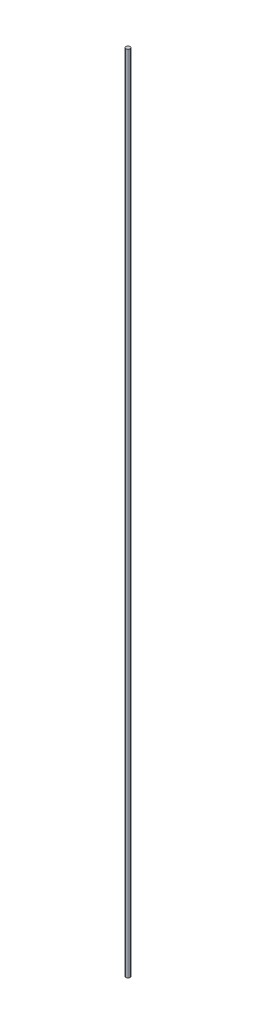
ISO-10303-21;
HEADER;
FILE_DESCRIPTION(('STEP AP214'),'2;1');
FILE_NAME('part.step','',(''),(''),'','','');
FILE_SCHEMA(('AUTOMOTIVE_DESIGN { 1 0 10303 214 1 1 1 1 }'));
ENDSEC;
DATA;
#1=APPLICATION_CONTEXT('core data for automotive mechanical design processes');
#2=APPLICATION_PROTOCOL_DEFINITION('international standard','automotive_design',2000,#1);
#3=PRODUCT_CONTEXT('',#1,'mechanical');
#4=PRODUCT('Part','Part','',(#3));
#5=PRODUCT_RELATED_PRODUCT_CATEGORY('part','',(#4));
#6=PRODUCT_DEFINITION_FORMATION('','',#4);
#7=PRODUCT_DEFINITION_CONTEXT('part definition',#1,'design');
#8=PRODUCT_DEFINITION('design','',#6,#7);
#9=PRODUCT_DEFINITION_SHAPE('','',#8);
#10=(LENGTH_UNIT() NAMED_UNIT(*) SI_UNIT(.MILLI.,.METRE.));
#11=(NAMED_UNIT(*) PLANE_ANGLE_UNIT() SI_UNIT($,.RADIAN.));
#12=(NAMED_UNIT(*) SI_UNIT($,.STERADIAN.) SOLID_ANGLE_UNIT());
#13=UNCERTAINTY_MEASURE_WITH_UNIT(LENGTH_MEASURE(1.E-05),#10,'distance_accuracy_value','');
#14=(GEOMETRIC_REPRESENTATION_CONTEXT(3) GLOBAL_UNCERTAINTY_ASSIGNED_CONTEXT((#13)) GLOBAL_UNIT_ASSIGNED_CONTEXT((#10,
#11,#12)) REPRESENTATION_CONTEXT('',''));
#15=CARTESIAN_POINT('',(0.,0.,0.));
#16=DIRECTION('',(0.,0.,1.));
#17=DIRECTION('',(1.,0.,0.));
#18=AXIS2_PLACEMENT_3D('',#15,#16,#17);
#19=CARTESIAN_POINT('',(0.,7620.,0.));
#20=DIRECTION('',(0.,-1.,0.));
#21=DIRECTION('',(0.,0.,-1.));
#22=AXIS2_PLACEMENT_3D('',#19,#20,#21);
#23=CYLINDRICAL_SURFACE('',#22,19.05);
#24=CARTESIAN_POINT('',(0.,7620.,0.));
#25=DIRECTION('',(0.,1.,0.));
#26=DIRECTION('',(0.,0.,1.));
#27=AXIS2_PLACEMENT_3D('',#24,#25,#26);
#28=CIRCLE('',#27,19.05);
#29=CARTESIAN_POINT('',(0.,7620.,19.05));
#30=VERTEX_POINT('',#29);
#31=EDGE_CURVE('E10',#30,#30,#28,.T.);
#32=ORIENTED_EDGE('',*,*,#31,.F.);
#33=EDGE_LOOP('',(#32));
#34=FACE_BOUND('',#33,.T.);
#35=CARTESIAN_POINT('',(0.,0.,0.));
#36=DIRECTION('',(0.,1.,0.));
#37=DIRECTION('',(0.,0.,1.));
#38=AXIS2_PLACEMENT_3D('',#35,#36,#37);
#39=CIRCLE('',#38,19.05);
#40=CARTESIAN_POINT('',(0.,0.,19.05));
#41=VERTEX_POINT('',#40);
#42=EDGE_CURVE('E34',#41,#41,#39,.T.);
#43=ORIENTED_EDGE('',*,*,#42,.T.);
#44=EDGE_LOOP('',(#43));
#45=FACE_BOUND('',#44,.T.);
#46=ADVANCED_FACE('F31',(#34,#45),#23,.T.);
#47=CARTESIAN_POINT('',(0.,7620.,0.));
#48=DIRECTION('',(0.,1.,0.));
#49=DIRECTION('',(0.,0.,1.));
#50=AXIS2_PLACEMENT_3D('',#47,#48,#49);
#51=PLANE('',#50);
#52=ORIENTED_EDGE('',*,*,#31,.T.);
#53=EDGE_LOOP('',(#52));
#54=FACE_BOUND('',#53,.T.);
#55=ADVANCED_FACE('F46',(#54),#51,.T.);
#56=CARTESIAN_POINT('',(0.,0.,0.));
#57=DIRECTION('',(0.,1.,0.));
#58=DIRECTION('',(0.,0.,1.));
#59=AXIS2_PLACEMENT_3D('',#56,#57,#58);
#60=PLANE('',#59);
#61=ORIENTED_EDGE('',*,*,#42,.F.);
#62=EDGE_LOOP('',(#61));
#63=FACE_BOUND('',#62,.T.);
#64=ADVANCED_FACE('F44',(#63),#60,.F.);
#65=CLOSED_SHELL('',(#46,#55,#64));
#66=MANIFOLD_SOLID_BREP('B2',#65);
#67=ADVANCED_BREP_SHAPE_REPRESENTATION('',(#18,#66),#14);
#68=SHAPE_DEFINITION_REPRESENTATION(#9,#67);
ENDSEC;
END-ISO-10303-21;
